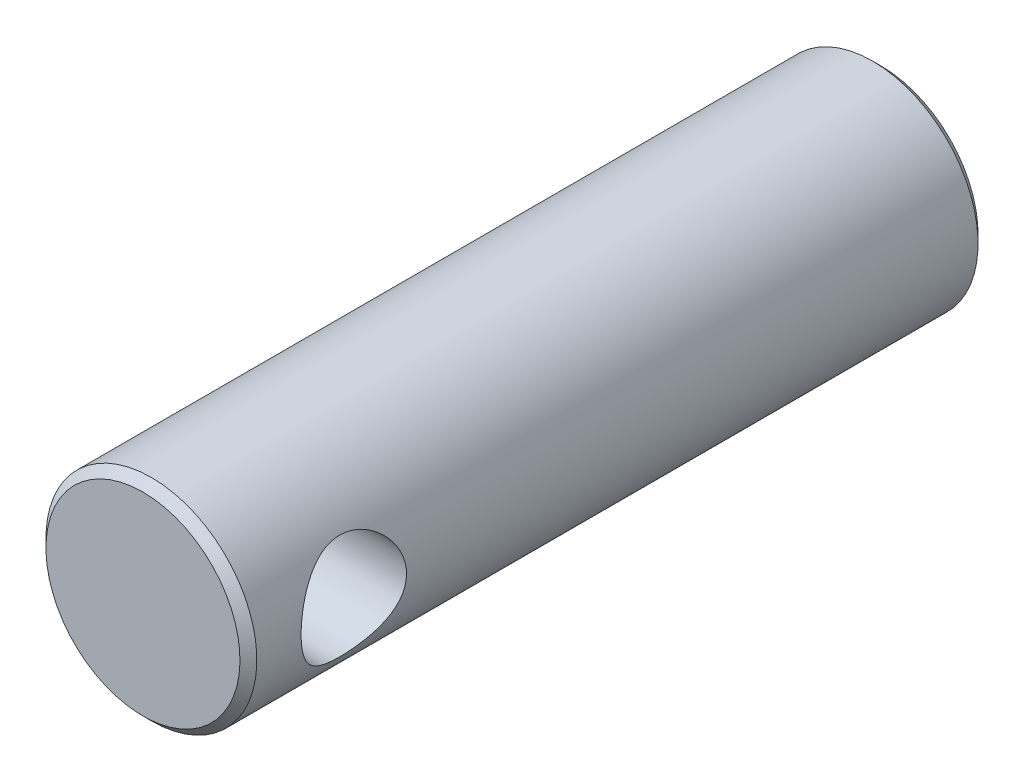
ISO-10303-21;
HEADER;
FILE_DESCRIPTION(('STEP AP214'),'2;1');
FILE_NAME('part.step','',(''),(''),'','','');
FILE_SCHEMA(('AUTOMOTIVE_DESIGN { 1 0 10303 214 1 1 1 1 }'));
ENDSEC;
DATA;
#1=APPLICATION_CONTEXT('core data for automotive mechanical design processes');
#2=APPLICATION_PROTOCOL_DEFINITION('international standard','automotive_design',2000,#1);
#3=PRODUCT_CONTEXT('',#1,'mechanical');
#4=PRODUCT('Part','Part','',(#3));
#5=PRODUCT_RELATED_PRODUCT_CATEGORY('part','',(#4));
#6=PRODUCT_DEFINITION_FORMATION('','',#4);
#7=PRODUCT_DEFINITION_CONTEXT('part definition',#1,'design');
#8=PRODUCT_DEFINITION('design','',#6,#7);
#9=PRODUCT_DEFINITION_SHAPE('','',#8);
#10=(LENGTH_UNIT() NAMED_UNIT(*) SI_UNIT(.MILLI.,.METRE.));
#11=(NAMED_UNIT(*) PLANE_ANGLE_UNIT() SI_UNIT($,.RADIAN.));
#12=(NAMED_UNIT(*) SI_UNIT($,.STERADIAN.) SOLID_ANGLE_UNIT());
#13=UNCERTAINTY_MEASURE_WITH_UNIT(LENGTH_MEASURE(1.E-05),#10,'distance_accuracy_value','');
#14=(GEOMETRIC_REPRESENTATION_CONTEXT(3) GLOBAL_UNCERTAINTY_ASSIGNED_CONTEXT((#13)) GLOBAL_UNIT_ASSIGNED_CONTEXT((#10,
#11,#12)) REPRESENTATION_CONTEXT('',''));
#15=CARTESIAN_POINT('',(0.,0.,0.));
#16=DIRECTION('',(0.,0.,1.));
#17=DIRECTION('',(1.,0.,0.));
#18=AXIS2_PLACEMENT_3D('',#15,#16,#17);
#19=CARTESIAN_POINT('',(0.,0.,0.));
#20=DIRECTION('',(0.,0.,-1.));
#21=DIRECTION('',(0.,1.,0.));
#22=AXIS2_PLACEMENT_3D('',#19,#20,#21);
#23=CYLINDRICAL_SURFACE('',#22,10.);
#24=CARTESIAN_POINT('',(0.,0.,0.8));
#25=DIRECTION('',(0.,0.,-1.));
#26=DIRECTION('',(0.,1.,0.));
#27=AXIS2_PLACEMENT_3D('',#24,#25,#26);
#28=CIRCLE('',#27,10.);
#29=CARTESIAN_POINT('',(0.,10.,0.8));
#30=VERTEX_POINT('',#29);
#31=EDGE_CURVE('E23',#30,#30,#28,.T.);
#32=ORIENTED_EDGE('',*,*,#31,.F.);
#33=EDGE_LOOP('',(#32));
#34=FACE_BOUND('',#33,.T.);
#35=CARTESIAN_POINT('',(10.,0.,55.));
#36=CARTESIAN_POINT('',(9.99999960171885,-0.13148889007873,55.000000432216));
#37=CARTESIAN_POINT('',(9.99740053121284,-0.262986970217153,55.0051927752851));
#38=CARTESIAN_POINT('',(9.98706977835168,-0.525014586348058,55.025902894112));
#39=CARTESIAN_POINT('',(9.97933586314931,-0.655543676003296,55.041425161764));
#40=CARTESIAN_POINT('',(9.95892066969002,-0.914783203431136,55.0826407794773));
#41=CARTESIAN_POINT('',(9.94623233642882,-1.04349077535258,55.1083486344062));
#42=CARTESIAN_POINT('',(9.91622716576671,-1.29802636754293,55.1696506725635));
#43=CARTESIAN_POINT('',(9.89890843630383,-1.42385318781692,55.2052488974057));
#44=CARTESIAN_POINT('',(9.86015430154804,-1.67121386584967,55.2857784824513));
#45=CARTESIAN_POINT('',(9.83873709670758,-1.79276399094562,55.3306686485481));
#46=CARTESIAN_POINT('',(9.79224427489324,-2.03144447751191,55.4294487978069));
#47=CARTESIAN_POINT('',(9.7671672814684,-2.14857315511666,55.4833421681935));
#48=CARTESIAN_POINT('',(9.68730860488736,-2.49222561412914,55.657799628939));
#49=CARTESIAN_POINT('',(9.6278546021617,-2.71128846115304,55.79123077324));
#50=CARTESIAN_POINT('',(9.49780663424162,-3.13758045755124,56.0976052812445));
#51=CARTESIAN_POINT('',(9.42675632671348,-3.34329192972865,56.2724506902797));
#52=CARTESIAN_POINT('',(9.28300214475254,-3.72388133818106,56.6525890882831));
#53=CARTESIAN_POINT('',(9.21029705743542,-3.89873577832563,56.8579050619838));
#54=CARTESIAN_POINT('',(9.06493867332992,-4.22628385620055,57.3124751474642));
#55=CARTESIAN_POINT('',(8.99272664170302,-4.37620734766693,57.5639018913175));
#56=CARTESIAN_POINT('',(8.89637417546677,-4.56723365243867,57.9599180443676));
#57=CARTESIAN_POINT('',(8.86624279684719,-4.62527981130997,58.0951182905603));
#58=CARTESIAN_POINT('',(8.81109611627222,-4.72948843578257,58.3710012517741));
#59=CARTESIAN_POINT('',(8.78607778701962,-4.77565793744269,58.5116806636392));
#60=CARTESIAN_POINT('',(8.74350562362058,-4.8531380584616,58.788992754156));
#61=CARTESIAN_POINT('',(8.72559704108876,-4.88516762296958,58.9253704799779));
#62=CARTESIAN_POINT('',(8.69596333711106,-4.93772573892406,59.2009256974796));
#63=CARTESIAN_POINT('',(8.68423493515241,-4.95826039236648,59.3401016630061));
#64=CARTESIAN_POINT('',(8.66746161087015,-4.98752398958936,59.6200074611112));
#65=CARTESIAN_POINT('',(8.66241266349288,-4.99626004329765,59.7607363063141));
#66=CARTESIAN_POINT('',(8.65921299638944,-5.00180399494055,60.0425011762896));
#67=CARTESIAN_POINT('',(8.66106161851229,-4.99861303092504,60.1835371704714));
#68=CARTESIAN_POINT('',(8.67093727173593,-4.98145803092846,60.447703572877));
#69=CARTESIAN_POINT('',(8.6781966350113,-4.96883208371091,60.5709526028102));
#70=CARTESIAN_POINT('',(8.69773906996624,-4.93454402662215,60.8158212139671));
#71=CARTESIAN_POINT('',(8.71002371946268,-4.91287907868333,60.937440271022));
#72=CARTESIAN_POINT('',(8.7392147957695,-4.86076278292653,61.1781978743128));
#73=CARTESIAN_POINT('',(8.75612065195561,-4.83031251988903,61.2973367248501));
#74=CARTESIAN_POINT('',(8.79403073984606,-4.76094319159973,61.5324713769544));
#75=CARTESIAN_POINT('',(8.81503658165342,-4.72202079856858,61.6484659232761));
#76=CARTESIAN_POINT('',(8.88436032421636,-4.59108661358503,61.9960068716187));
#77=CARTESIAN_POINT('',(8.93828791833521,-4.48608785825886,62.2216933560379));
#78=CARTESIAN_POINT('',(9.05517433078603,-4.24519591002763,62.6532101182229));
#79=CARTESIAN_POINT('',(9.11813720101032,-4.10928884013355,62.8590314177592));
#80=CARTESIAN_POINT('',(9.25565455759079,-3.79034422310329,63.2725885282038));
#81=CARTESIAN_POINT('',(9.33066654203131,-3.60351571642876,63.4772580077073));
#82=CARTESIAN_POINT('',(9.47739013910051,-3.19773444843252,63.8537034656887));
#83=CARTESIAN_POINT('',(9.54910016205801,-2.978766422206,64.0254637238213));
#84=CARTESIAN_POINT('',(9.65034506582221,-2.62430600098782,64.2584408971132));
#85=CARTESIAN_POINT('',(9.68370380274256,-2.49871002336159,64.3333520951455));
#86=CARTESIAN_POINT('',(9.74663052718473,-2.24071060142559,64.4722082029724));
#87=CARTESIAN_POINT('',(9.77620011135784,-2.10831005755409,64.5361577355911));
#88=CARTESIAN_POINT('',(9.83067553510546,-1.83762803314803,64.6523988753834));
#89=CARTESIAN_POINT('',(9.85558325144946,-1.69934894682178,64.7046951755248));
#90=CARTESIAN_POINT('',(9.89999026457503,-1.41791187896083,64.79702492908));
#91=CARTESIAN_POINT('',(9.91949018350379,-1.27475446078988,64.8370597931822));
#92=CARTESIAN_POINT('',(9.95109597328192,-0.996798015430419,64.901533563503));
#93=CARTESIAN_POINT('',(9.96368046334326,-0.8622886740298,64.9269895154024));
#94=CARTESIAN_POINT('',(9.98343035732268,-0.591248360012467,64.9668080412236));
#95=CARTESIAN_POINT('',(9.99059624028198,-0.454717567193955,64.9811715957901));
#96=CARTESIAN_POINT('',(9.99930380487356,-0.180810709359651,64.9986131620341));
#97=CARTESIAN_POINT('',(10.000847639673,-0.043434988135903,65.0016954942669));
#98=CARTESIAN_POINT('',(9.99827237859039,0.231047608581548,64.9965444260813));
#99=CARTESIAN_POINT('',(9.99415353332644,0.368154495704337,64.9883115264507));
#100=CARTESIAN_POINT('',(9.98090973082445,0.630324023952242,64.961721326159));
#101=CARTESIAN_POINT('',(9.97219922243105,0.755493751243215,64.9442016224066));
#102=CARTESIAN_POINT('',(9.95027227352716,1.00380426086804,64.8998255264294));
#103=CARTESIAN_POINT('',(9.93705440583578,1.12694438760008,64.8729661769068));
#104=CARTESIAN_POINT('',(9.90642450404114,1.37032307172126,64.8101973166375));
#105=CARTESIAN_POINT('',(9.88901375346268,1.49056250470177,64.7742905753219));
#106=CARTESIAN_POINT('',(9.85039368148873,1.72747946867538,64.6937718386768));
#107=CARTESIAN_POINT('',(9.8291829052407,1.84415561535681,64.6491565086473));
#108=CARTESIAN_POINT('',(9.75922876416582,2.19430354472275,64.5000521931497));
#109=CARTESIAN_POINT('',(9.70504904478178,2.42111320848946,64.3820592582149));
#110=CARTESIAN_POINT('',(9.58719375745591,2.85234560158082,64.1144478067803));
#111=CARTESIAN_POINT('',(9.5235141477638,3.05675873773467,63.9648158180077));
#112=CARTESIAN_POINT('',(9.38541505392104,3.45882132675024,63.6212127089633));
#113=CARTESIAN_POINT('',(9.31055499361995,3.65383533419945,63.4243304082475));
#114=CARTESIAN_POINT('',(9.16310881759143,4.00930667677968,63.0003294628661));
#115=CARTESIAN_POINT('',(9.09052430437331,4.16974010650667,62.7731900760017));
#116=CARTESIAN_POINT('',(8.98785260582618,4.38466016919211,62.4075094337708));
#117=CARTESIAN_POINT('',(8.95395955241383,4.45326762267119,62.2781491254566));
#118=CARTESIAN_POINT('',(8.89022352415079,4.57918112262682,62.0131058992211));
#119=CARTESIAN_POINT('',(8.8603787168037,4.63649228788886,61.8774258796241));
#120=CARTESIAN_POINT('',(8.80590327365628,4.73913999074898,61.6007229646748));
#121=CARTESIAN_POINT('',(8.78126837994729,4.78448631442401,61.45970454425));
#122=CARTESIAN_POINT('',(8.73822819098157,4.86265004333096,61.1733089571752));
#123=CARTESIAN_POINT('',(8.71982193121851,4.89546938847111,61.0279324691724));
#124=CARTESIAN_POINT('',(8.69151275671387,4.94553834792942,60.7482350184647));
#125=CARTESIAN_POINT('',(8.68096327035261,4.96397997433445,60.61419211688));
#126=CARTESIAN_POINT('',(8.66606824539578,4.98993873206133,60.3447147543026));
#127=CARTESIAN_POINT('',(8.66172205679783,4.99745700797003,60.2092804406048));
#128=CARTESIAN_POINT('',(8.65941425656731,5.00145477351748,59.9382430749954));
#129=CARTESIAN_POINT('',(8.66145040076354,4.99793814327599,59.8026400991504));
#130=CARTESIAN_POINT('',(8.67181681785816,4.97992974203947,59.5324144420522));
#131=CARTESIAN_POINT('',(8.68014683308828,4.96543842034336,59.3977917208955));
#132=CARTESIAN_POINT('',(8.70167828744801,4.92759757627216,59.143439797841));
#133=CARTESIAN_POINT('',(8.71433770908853,4.90522766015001,59.0235174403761));
#134=CARTESIAN_POINT('',(8.74411599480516,4.85194376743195,58.7861388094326));
#135=CARTESIAN_POINT('',(8.76123623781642,4.82102714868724,58.668683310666));
#136=CARTESIAN_POINT('',(8.81854231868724,4.7159030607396,58.3210828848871));
#137=CARTESIAN_POINT('',(8.86468813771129,4.62929708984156,58.095543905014));
#138=CARTESIAN_POINT('',(8.97142890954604,4.41907164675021,57.6468396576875));
#139=CARTESIAN_POINT('',(9.03278633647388,4.29335633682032,57.4248519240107));
#140=CARTESIAN_POINT('',(9.16176636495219,4.01075421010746,57.0036358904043));
#141=CARTESIAN_POINT('',(9.22939221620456,3.85385117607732,56.8044195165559));
#142=CARTESIAN_POINT('',(9.37311444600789,3.49102748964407,56.4092921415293));
#143=CARTESIAN_POINT('',(9.44924162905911,3.28146736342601,56.2167239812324));
#144=CARTESIAN_POINT('',(9.59389514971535,2.83072875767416,55.8686655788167));
#145=CARTESIAN_POINT('',(9.66241737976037,2.58953334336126,55.7131953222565));
#146=CARTESIAN_POINT('',(9.7541901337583,2.20753881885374,55.5113695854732));
#147=CARTESIAN_POINT('',(9.78304209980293,2.07625512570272,55.4491329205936));
#148=CARTESIAN_POINT('',(9.83614745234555,1.80799529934,55.3360638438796));
#149=CARTESIAN_POINT('',(9.86040309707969,1.67102200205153,55.2852258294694));
#150=CARTESIAN_POINT('',(9.90354484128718,1.39269501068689,55.1956545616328));
#151=CARTESIAN_POINT('',(9.92244264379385,1.25135162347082,55.1568949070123));
#152=CARTESIAN_POINT('',(9.95434618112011,0.965237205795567,55.0918624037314));
#153=CARTESIAN_POINT('',(9.96735551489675,0.820468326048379,55.065581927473));
#154=CARTESIAN_POINT('',(9.98476387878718,0.563041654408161,55.0305254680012));
#155=CARTESIAN_POINT('',(9.99046741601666,0.450825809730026,55.019088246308));
#156=CARTESIAN_POINT('',(9.99808569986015,0.225742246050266,55.0038252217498));
#157=CARTESIAN_POINT('',(10.000000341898,0.112874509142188,54.9999996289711));
#158=CARTESIAN_POINT('',(10.,0.,55.));
#159=B_SPLINE_CURVE_WITH_KNOTS('',3,(#35,#36,#37,#38,#39,#40,#41,#42,#43,#44,#45,#46,#47,#48,
#49,#50,#51,#52,#53,#54,#55,#56,#57,#58,#59,#60,#61,#62,#63,#64,#65,#66,#67,#68,#69,#70,#71,#72,
#73,#74,#75,#76,#77,#78,#79,#80,#81,#82,#83,#84,#85,#86,#87,#88,#89,#90,#91,#92,#93,#94,#95,#96,
#97,#98,#99,#100,#101,#102,#103,#104,#105,#106,#107,#108,#109,#110,#111,#112,#113,#114,#115,
#116,#117,#118,#119,#120,#121,#122,#123,#124,#125,#126,#127,#128,#129,#130,#131,#132,#133,#134,
#135,#136,#137,#138,#139,#140,#141,#142,#143,#144,#145,#146,#147,#148,#149,#150,#151,#152,#153,
#154,#155,#156,#157,#158),.UNSPECIFIED.,.T.,.F.,(4,2,2,2,2,2,2,2,2,2,2,2,2,2,2,2,2,2,2,2,2,2,2,
2,2,2,2,2,2,2,2,2,2,2,2,2,2,2,2,2,2,2,2,2,2,2,2,2,2,2,2,2,2,2,2,2,2,2,2,2,2,4),(0.,
0.394355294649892,0.788882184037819,1.18397293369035,1.57922537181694,1.97276168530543,
2.36644639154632,3.15295441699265,3.98704440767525,4.82176680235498,5.72122193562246,
6.1712535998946,6.62101803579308,7.04410338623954,7.4669639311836,7.88956954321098,
8.31213483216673,8.68401534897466,9.05601271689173,9.42796417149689,9.80006198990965,
10.5608338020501,11.3219478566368,12.1795688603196,13.03759852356,13.4870830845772,
13.9363776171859,14.3854908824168,14.8345524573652,15.2464230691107,15.6582572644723,
16.0699337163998,16.4815919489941,16.8612200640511,17.240968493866,17.6206008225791,
18.0003788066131,18.7808755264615,19.5617052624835,20.4192132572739,21.2773121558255,
21.7277011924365,22.1778856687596,22.6277007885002,23.0774462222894,23.4840267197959,
23.8905646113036,24.2969595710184,24.703337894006,25.0708552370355,25.4384863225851,
26.1732662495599,26.9574126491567,27.7419678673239,28.6218519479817,29.5022089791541,
29.9460734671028,30.3897193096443,30.8323885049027,31.2747867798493,31.6133053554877,
31.9518332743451),.UNSPECIFIED.);
#160=CARTESIAN_POINT('',(10.,0.,55.));
#161=VERTEX_POINT('',#160);
#162=EDGE_CURVE('E30',#161,#161,#159,.T.);
#163=ORIENTED_EDGE('',*,*,#162,.T.);
#164=EDGE_LOOP('',(#163));
#165=FACE_BOUND('',#164,.T.);
#166=CARTESIAN_POINT('',(0.,0.,69.2));
#167=DIRECTION('',(0.,0.,-1.));
#168=DIRECTION('',(0.,1.,0.));
#169=AXIS2_PLACEMENT_3D('',#166,#167,#168);
#170=CIRCLE('',#169,10.);
#171=CARTESIAN_POINT('',(0.,10.,69.2));
#172=VERTEX_POINT('',#171);
#173=EDGE_CURVE('E37',#172,#172,#170,.T.);
#174=ORIENTED_EDGE('',*,*,#173,.T.);
#175=EDGE_LOOP('',(#174));
#176=FACE_BOUND('',#175,.T.);
#177=CARTESIAN_POINT('',(-10.,0.,55.));
#178=CARTESIAN_POINT('',(-9.99999960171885,0.13148889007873,55.000000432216));
#179=CARTESIAN_POINT('',(-9.99740053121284,0.262986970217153,55.0051927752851));
#180=CARTESIAN_POINT('',(-9.98706977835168,0.525014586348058,55.025902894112));
#181=CARTESIAN_POINT('',(-9.97933586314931,0.655543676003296,55.041425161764));
#182=CARTESIAN_POINT('',(-9.95892066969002,0.914783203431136,55.0826407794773));
#183=CARTESIAN_POINT('',(-9.94623233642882,1.04349077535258,55.1083486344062));
#184=CARTESIAN_POINT('',(-9.91622716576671,1.29802636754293,55.1696506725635));
#185=CARTESIAN_POINT('',(-9.89890843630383,1.42385318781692,55.2052488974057));
#186=CARTESIAN_POINT('',(-9.86015430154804,1.67121386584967,55.2857784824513));
#187=CARTESIAN_POINT('',(-9.83873709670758,1.79276399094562,55.3306686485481));
#188=CARTESIAN_POINT('',(-9.79224427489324,2.03144447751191,55.4294487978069));
#189=CARTESIAN_POINT('',(-9.7671672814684,2.14857315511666,55.4833421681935));
#190=CARTESIAN_POINT('',(-9.68730860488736,2.49222561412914,55.657799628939));
#191=CARTESIAN_POINT('',(-9.6278546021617,2.71128846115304,55.79123077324));
#192=CARTESIAN_POINT('',(-9.49780663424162,3.13758045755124,56.0976052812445));
#193=CARTESIAN_POINT('',(-9.42675632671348,3.34329192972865,56.2724506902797));
#194=CARTESIAN_POINT('',(-9.28300214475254,3.72388133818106,56.6525890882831));
#195=CARTESIAN_POINT('',(-9.21029705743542,3.89873577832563,56.8579050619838));
#196=CARTESIAN_POINT('',(-9.06493867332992,4.22628385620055,57.3124751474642));
#197=CARTESIAN_POINT('',(-8.99272664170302,4.37620734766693,57.5639018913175));
#198=CARTESIAN_POINT('',(-8.89637417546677,4.56723365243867,57.9599180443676));
#199=CARTESIAN_POINT('',(-8.86624279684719,4.62527981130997,58.0951182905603));
#200=CARTESIAN_POINT('',(-8.81109611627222,4.72948843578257,58.3710012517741));
#201=CARTESIAN_POINT('',(-8.78607778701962,4.77565793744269,58.5116806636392));
#202=CARTESIAN_POINT('',(-8.74350562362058,4.8531380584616,58.788992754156));
#203=CARTESIAN_POINT('',(-8.72559704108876,4.88516762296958,58.9253704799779));
#204=CARTESIAN_POINT('',(-8.69596333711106,4.93772573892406,59.2009256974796));
#205=CARTESIAN_POINT('',(-8.68423493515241,4.95826039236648,59.3401016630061));
#206=CARTESIAN_POINT('',(-8.66746161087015,4.98752398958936,59.6200074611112));
#207=CARTESIAN_POINT('',(-8.66241266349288,4.99626004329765,59.7607363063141));
#208=CARTESIAN_POINT('',(-8.65921299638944,5.00180399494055,60.0425011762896));
#209=CARTESIAN_POINT('',(-8.66106161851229,4.99861303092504,60.1835371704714));
#210=CARTESIAN_POINT('',(-8.67093727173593,4.98145803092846,60.447703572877));
#211=CARTESIAN_POINT('',(-8.6781966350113,4.96883208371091,60.5709526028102));
#212=CARTESIAN_POINT('',(-8.69773906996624,4.93454402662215,60.8158212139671));
#213=CARTESIAN_POINT('',(-8.71002371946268,4.91287907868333,60.937440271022));
#214=CARTESIAN_POINT('',(-8.7392147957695,4.86076278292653,61.1781978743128));
#215=CARTESIAN_POINT('',(-8.75612065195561,4.83031251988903,61.2973367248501));
#216=CARTESIAN_POINT('',(-8.79403073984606,4.76094319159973,61.5324713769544));
#217=CARTESIAN_POINT('',(-8.81503658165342,4.72202079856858,61.6484659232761));
#218=CARTESIAN_POINT('',(-8.88436032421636,4.59108661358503,61.9960068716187));
#219=CARTESIAN_POINT('',(-8.93828791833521,4.48608785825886,62.2216933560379));
#220=CARTESIAN_POINT('',(-9.05517433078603,4.24519591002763,62.6532101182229));
#221=CARTESIAN_POINT('',(-9.11813720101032,4.10928884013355,62.8590314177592));
#222=CARTESIAN_POINT('',(-9.25565455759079,3.79034422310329,63.2725885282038));
#223=CARTESIAN_POINT('',(-9.33066654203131,3.60351571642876,63.4772580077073));
#224=CARTESIAN_POINT('',(-9.47739013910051,3.19773444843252,63.8537034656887));
#225=CARTESIAN_POINT('',(-9.54910016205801,2.978766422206,64.0254637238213));
#226=CARTESIAN_POINT('',(-9.65034506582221,2.62430600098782,64.2584408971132));
#227=CARTESIAN_POINT('',(-9.68370380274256,2.49871002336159,64.3333520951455));
#228=CARTESIAN_POINT('',(-9.74663052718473,2.24071060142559,64.4722082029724));
#229=CARTESIAN_POINT('',(-9.77620011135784,2.10831005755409,64.5361577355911));
#230=CARTESIAN_POINT('',(-9.83067553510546,1.83762803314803,64.6523988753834));
#231=CARTESIAN_POINT('',(-9.85558325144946,1.69934894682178,64.7046951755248));
#232=CARTESIAN_POINT('',(-9.89999026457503,1.41791187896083,64.79702492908));
#233=CARTESIAN_POINT('',(-9.91949018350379,1.27475446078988,64.8370597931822));
#234=CARTESIAN_POINT('',(-9.95109597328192,0.996798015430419,64.901533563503));
#235=CARTESIAN_POINT('',(-9.96368046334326,0.8622886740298,64.9269895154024));
#236=CARTESIAN_POINT('',(-9.98343035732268,0.591248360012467,64.9668080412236));
#237=CARTESIAN_POINT('',(-9.99059624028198,0.454717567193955,64.9811715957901));
#238=CARTESIAN_POINT('',(-9.99930380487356,0.180810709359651,64.9986131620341));
#239=CARTESIAN_POINT('',(-10.000847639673,0.043434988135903,65.0016954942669));
#240=CARTESIAN_POINT('',(-9.99827237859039,-0.231047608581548,64.9965444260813));
#241=CARTESIAN_POINT('',(-9.99415353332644,-0.368154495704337,64.9883115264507));
#242=CARTESIAN_POINT('',(-9.98090973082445,-0.630324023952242,64.961721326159));
#243=CARTESIAN_POINT('',(-9.97219922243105,-0.755493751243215,64.9442016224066));
#244=CARTESIAN_POINT('',(-9.95027227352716,-1.00380426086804,64.8998255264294));
#245=CARTESIAN_POINT('',(-9.93705440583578,-1.12694438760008,64.8729661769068));
#246=CARTESIAN_POINT('',(-9.90642450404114,-1.37032307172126,64.8101973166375));
#247=CARTESIAN_POINT('',(-9.88901375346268,-1.49056250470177,64.7742905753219));
#248=CARTESIAN_POINT('',(-9.85039368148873,-1.72747946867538,64.6937718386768));
#249=CARTESIAN_POINT('',(-9.8291829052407,-1.84415561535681,64.6491565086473));
#250=CARTESIAN_POINT('',(-9.75922876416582,-2.19430354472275,64.5000521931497));
#251=CARTESIAN_POINT('',(-9.70504904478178,-2.42111320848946,64.3820592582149));
#252=CARTESIAN_POINT('',(-9.58719375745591,-2.85234560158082,64.1144478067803));
#253=CARTESIAN_POINT('',(-9.5235141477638,-3.05675873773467,63.9648158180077));
#254=CARTESIAN_POINT('',(-9.38541505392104,-3.45882132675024,63.6212127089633));
#255=CARTESIAN_POINT('',(-9.31055499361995,-3.65383533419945,63.4243304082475));
#256=CARTESIAN_POINT('',(-9.16310881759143,-4.00930667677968,63.0003294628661));
#257=CARTESIAN_POINT('',(-9.09052430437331,-4.16974010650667,62.7731900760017));
#258=CARTESIAN_POINT('',(-8.98785260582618,-4.38466016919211,62.4075094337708));
#259=CARTESIAN_POINT('',(-8.95395955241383,-4.45326762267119,62.2781491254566));
#260=CARTESIAN_POINT('',(-8.89022352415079,-4.57918112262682,62.0131058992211));
#261=CARTESIAN_POINT('',(-8.8603787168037,-4.63649228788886,61.8774258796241));
#262=CARTESIAN_POINT('',(-8.80590327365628,-4.73913999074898,61.6007229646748));
#263=CARTESIAN_POINT('',(-8.78126837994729,-4.78448631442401,61.45970454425));
#264=CARTESIAN_POINT('',(-8.73822819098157,-4.86265004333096,61.1733089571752));
#265=CARTESIAN_POINT('',(-8.71982193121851,-4.89546938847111,61.0279324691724));
#266=CARTESIAN_POINT('',(-8.69151275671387,-4.94553834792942,60.7482350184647));
#267=CARTESIAN_POINT('',(-8.68096327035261,-4.96397997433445,60.61419211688));
#268=CARTESIAN_POINT('',(-8.66606824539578,-4.98993873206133,60.3447147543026));
#269=CARTESIAN_POINT('',(-8.66172205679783,-4.99745700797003,60.2092804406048));
#270=CARTESIAN_POINT('',(-8.65941425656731,-5.00145477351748,59.9382430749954));
#271=CARTESIAN_POINT('',(-8.66145040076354,-4.99793814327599,59.8026400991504));
#272=CARTESIAN_POINT('',(-8.67181681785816,-4.97992974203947,59.5324144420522));
#273=CARTESIAN_POINT('',(-8.68014683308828,-4.96543842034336,59.3977917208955));
#274=CARTESIAN_POINT('',(-8.70167828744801,-4.92759757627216,59.143439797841));
#275=CARTESIAN_POINT('',(-8.71433770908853,-4.90522766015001,59.0235174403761));
#276=CARTESIAN_POINT('',(-8.74411599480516,-4.85194376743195,58.7861388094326));
#277=CARTESIAN_POINT('',(-8.76123623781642,-4.82102714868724,58.668683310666));
#278=CARTESIAN_POINT('',(-8.81854231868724,-4.7159030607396,58.3210828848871));
#279=CARTESIAN_POINT('',(-8.86468813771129,-4.62929708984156,58.095543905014));
#280=CARTESIAN_POINT('',(-8.97142890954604,-4.41907164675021,57.6468396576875));
#281=CARTESIAN_POINT('',(-9.03278633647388,-4.29335633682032,57.4248519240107));
#282=CARTESIAN_POINT('',(-9.16176636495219,-4.01075421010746,57.0036358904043));
#283=CARTESIAN_POINT('',(-9.22939221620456,-3.85385117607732,56.8044195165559));
#284=CARTESIAN_POINT('',(-9.37311444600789,-3.49102748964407,56.4092921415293));
#285=CARTESIAN_POINT('',(-9.44924162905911,-3.28146736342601,56.2167239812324));
#286=CARTESIAN_POINT('',(-9.59389514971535,-2.83072875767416,55.8686655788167));
#287=CARTESIAN_POINT('',(-9.66241737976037,-2.58953334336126,55.7131953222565));
#288=CARTESIAN_POINT('',(-9.7541901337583,-2.20753881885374,55.5113695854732));
#289=CARTESIAN_POINT('',(-9.78304209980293,-2.07625512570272,55.4491329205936));
#290=CARTESIAN_POINT('',(-9.83614745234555,-1.80799529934,55.3360638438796));
#291=CARTESIAN_POINT('',(-9.86040309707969,-1.67102200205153,55.2852258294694));
#292=CARTESIAN_POINT('',(-9.90354484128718,-1.39269501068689,55.1956545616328));
#293=CARTESIAN_POINT('',(-9.92244264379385,-1.25135162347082,55.1568949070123));
#294=CARTESIAN_POINT('',(-9.95434618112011,-0.965237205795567,55.0918624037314));
#295=CARTESIAN_POINT('',(-9.96735551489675,-0.820468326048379,55.065581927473));
#296=CARTESIAN_POINT('',(-9.98476387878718,-0.563041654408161,55.0305254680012));
#297=CARTESIAN_POINT('',(-9.99046741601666,-0.450825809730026,55.019088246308));
#298=CARTESIAN_POINT('',(-9.99808569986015,-0.225742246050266,55.0038252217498));
#299=CARTESIAN_POINT('',(-10.000000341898,-0.112874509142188,54.9999996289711));
#300=CARTESIAN_POINT('',(-10.,0.,55.));
#301=B_SPLINE_CURVE_WITH_KNOTS('',3,(#177,#178,#179,#180,#181,#182,#183,#184,#185,#186,#187,
#188,#189,#190,#191,#192,#193,#194,#195,#196,#197,#198,#199,#200,#201,#202,#203,#204,#205,#206,
#207,#208,#209,#210,#211,#212,#213,#214,#215,#216,#217,#218,#219,#220,#221,#222,#223,#224,#225,
#226,#227,#228,#229,#230,#231,#232,#233,#234,#235,#236,#237,#238,#239,#240,#241,#242,#243,#244,
#245,#246,#247,#248,#249,#250,#251,#252,#253,#254,#255,#256,#257,#258,#259,#260,#261,#262,#263,
#264,#265,#266,#267,#268,#269,#270,#271,#272,#273,#274,#275,#276,#277,#278,#279,#280,#281,#282,
#283,#284,#285,#286,#287,#288,#289,#290,#291,#292,#293,#294,#295,#296,#297,#298,#299,#300),
.UNSPECIFIED.,.T.,.F.,(4,2,2,2,2,2,2,2,2,2,2,2,2,2,2,2,2,2,2,2,2,2,2,2,2,2,2,2,2,2,2,2,2,2,2,2,
2,2,2,2,2,2,2,2,2,2,2,2,2,2,2,2,2,2,2,2,2,2,2,2,2,4),(0.,0.394355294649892,0.788882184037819,
1.18397293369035,1.57922537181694,1.97276168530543,2.36644639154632,3.15295441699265,
3.98704440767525,4.82176680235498,5.72122193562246,6.1712535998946,6.62101803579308,
7.04410338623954,7.4669639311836,7.88956954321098,8.31213483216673,8.68401534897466,
9.05601271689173,9.42796417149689,9.80006198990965,10.5608338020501,11.3219478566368,
12.1795688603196,13.03759852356,13.4870830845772,13.9363776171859,14.3854908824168,
14.8345524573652,15.2464230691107,15.6582572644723,16.0699337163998,16.4815919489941,
16.8612200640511,17.240968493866,17.6206008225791,18.0003788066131,18.7808755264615,
19.5617052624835,20.4192132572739,21.2773121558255,21.7277011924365,22.1778856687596,
22.6277007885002,23.0774462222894,23.4840267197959,23.8905646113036,24.2969595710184,
24.703337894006,25.0708552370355,25.4384863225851,26.1732662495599,26.9574126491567,
27.7419678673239,28.6218519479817,29.5022089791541,29.9460734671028,30.3897193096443,
30.8323885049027,31.2747867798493,31.6133053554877,31.9518332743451),.UNSPECIFIED.);
#302=CARTESIAN_POINT('',(-10.,0.,55.));
#303=VERTEX_POINT('',#302);
#304=EDGE_CURVE('E39',#303,#303,#301,.T.);
#305=ORIENTED_EDGE('',*,*,#304,.T.);
#306=EDGE_LOOP('',(#305));
#307=FACE_BOUND('',#306,.T.);
#308=ADVANCED_FACE('F12',(#34,#165,#176,#307),#23,.T.);
#309=CARTESIAN_POINT('',(9.2,0.,0.));
#310=DIRECTION('',(0.,0.,1.));
#311=DIRECTION('',(0.,-1.,0.));
#312=AXIS2_PLACEMENT_3D('',#309,#310,#311);
#313=PLANE('',#312);
#314=CARTESIAN_POINT('',(0.,0.,0.));
#315=DIRECTION('',(0.,0.,1.));
#316=DIRECTION('',(1.,0.,0.));
#317=AXIS2_PLACEMENT_3D('',#314,#315,#316);
#318=CIRCLE('',#317,7.);
#319=CARTESIAN_POINT('',(7.,0.,0.));
#320=VERTEX_POINT('',#319);
#321=EDGE_CURVE('E8',#320,#320,#318,.T.);
#322=ORIENTED_EDGE('',*,*,#321,.T.);
#323=EDGE_LOOP('',(#322));
#324=FACE_BOUND('',#323,.T.);
#325=CARTESIAN_POINT('',(0.,0.,0.));
#326=DIRECTION('',(0.,0.,-1.));
#327=DIRECTION('',(0.,1.,0.));
#328=AXIS2_PLACEMENT_3D('',#325,#326,#327);
#329=CIRCLE('',#328,9.2);
#330=CARTESIAN_POINT('',(0.,9.2,0.));
#331=VERTEX_POINT('',#330);
#332=EDGE_CURVE('E84',#331,#331,#329,.T.);
#333=ORIENTED_EDGE('',*,*,#332,.T.);
#334=EDGE_LOOP('',(#333));
#335=FACE_BOUND('',#334,.T.);
#336=ADVANCED_FACE('F54',(#324,#335),#313,.F.);
#337=CARTESIAN_POINT('',(0.,0.,70.));
#338=DIRECTION('',(0.,0.,-1.));
#339=DIRECTION('',(0.,1.,0.));
#340=AXIS2_PLACEMENT_3D('',#337,#338,#339);
#341=PLANE('',#340);
#342=CARTESIAN_POINT('',(0.,0.,70.));
#343=DIRECTION('',(0.,0.,-1.));
#344=DIRECTION('',(0.,1.,0.));
#345=AXIS2_PLACEMENT_3D('',#342,#343,#344);
#346=CIRCLE('',#345,9.2);
#347=CARTESIAN_POINT('',(0.,9.2,70.));
#348=VERTEX_POINT('',#347);
#349=EDGE_CURVE('E27',#348,#348,#346,.T.);
#350=ORIENTED_EDGE('',*,*,#349,.F.);
#351=EDGE_LOOP('',(#350));
#352=FACE_BOUND('',#351,.T.);
#353=ADVANCED_FACE('F57',(#352),#341,.F.);
#354=CARTESIAN_POINT('',(0.,0.,70.));
#355=DIRECTION('',(0.,0.,-1.));
#356=DIRECTION('',(0.,1.,0.));
#357=AXIS2_PLACEMENT_3D('',#354,#355,#356);
#358=CONICAL_SURFACE('',#357,9.2,0.785398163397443);
#359=ORIENTED_EDGE('',*,*,#173,.F.);
#360=EDGE_LOOP('',(#359));
#361=FACE_BOUND('',#360,.T.);
#362=ORIENTED_EDGE('',*,*,#349,.T.);
#363=EDGE_LOOP('',(#362));
#364=FACE_BOUND('',#363,.T.);
#365=ADVANCED_FACE('F59',(#361,#364),#358,.T.);
#366=CARTESIAN_POINT('',(0.,0.,0.8));
#367=DIRECTION('',(0.,0.,1.));
#368=DIRECTION('',(0.,-1.,0.));
#369=AXIS2_PLACEMENT_3D('',#366,#367,#368);
#370=CONICAL_SURFACE('',#369,10.,0.785398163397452);
#371=ORIENTED_EDGE('',*,*,#332,.F.);
#372=EDGE_LOOP('',(#371));
#373=FACE_BOUND('',#372,.T.);
#374=ORIENTED_EDGE('',*,*,#31,.T.);
#375=EDGE_LOOP('',(#374));
#376=FACE_BOUND('',#375,.T.);
#377=ADVANCED_FACE('F52',(#373,#376),#370,.T.);
#378=CARTESIAN_POINT('',(-20.001,0.,60.));
#379=DIRECTION('',(1.,0.,0.));
#380=DIRECTION('',(0.,0.,-1.));
#381=AXIS2_PLACEMENT_3D('',#378,#379,#380);
#382=CYLINDRICAL_SURFACE('',#381,5.);
#383=ORIENTED_EDGE('',*,*,#162,.F.);
#384=EDGE_LOOP('',(#383));
#385=FACE_BOUND('',#384,.T.);
#386=ORIENTED_EDGE('',*,*,#304,.F.);
#387=EDGE_LOOP('',(#386));
#388=FACE_BOUND('',#387,.T.);
#389=ADVANCED_FACE('F47',(#385,#388),#382,.F.);
#390=CARTESIAN_POINT('',(0.,0.,25.));
#391=DIRECTION('',(0.,0.,-1.));
#392=DIRECTION('',(-1.,0.,0.));
#393=AXIS2_PLACEMENT_3D('',#390,#391,#392);
#394=CYLINDRICAL_SURFACE('',#393,6.);
#395=CARTESIAN_POINT('',(0.,0.,1.00000000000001));
#396=DIRECTION('',(0.,0.,1.));
#397=DIRECTION('',(1.,0.,0.));
#398=AXIS2_PLACEMENT_3D('',#395,#396,#397);
#399=CIRCLE('',#398,6.);
#400=CARTESIAN_POINT('',(6.,0.,1.00000000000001));
#401=VERTEX_POINT('',#400);
#402=EDGE_CURVE('E19',#401,#401,#399,.F.);
#403=ORIENTED_EDGE('',*,*,#402,.T.);
#404=EDGE_LOOP('',(#403));
#405=FACE_BOUND('',#404,.T.);
#406=CARTESIAN_POINT('',(0.,0.,25.));
#407=DIRECTION('',(0.,0.,-1.));
#408=DIRECTION('',(-1.,0.,0.));
#409=AXIS2_PLACEMENT_3D('',#406,#407,#408);
#410=CIRCLE('',#409,6.);
#411=CARTESIAN_POINT('',(-6.,0.,25.));
#412=VERTEX_POINT('',#411);
#413=EDGE_CURVE('E38',#412,#412,#410,.T.);
#414=ORIENTED_EDGE('',*,*,#413,.F.);
#415=EDGE_LOOP('',(#414));
#416=FACE_BOUND('',#415,.T.);
#417=ADVANCED_FACE('F51',(#405,#416),#394,.F.);
#418=CARTESIAN_POINT('',(0.,0.,25.));
#419=DIRECTION('',(0.,0.,-1.));
#420=DIRECTION('',(-1.,0.,0.));
#421=AXIS2_PLACEMENT_3D('',#418,#419,#420);
#422=PLANE('',#421);
#423=ORIENTED_EDGE('',*,*,#413,.T.);
#424=EDGE_LOOP('',(#423));
#425=FACE_BOUND('',#424,.T.);
#426=ADVANCED_FACE('F93',(#425),#422,.T.);
#427=CARTESIAN_POINT('',(0.,0.,1.00000000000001));
#428=DIRECTION('',(0.,0.,-1.));
#429=DIRECTION('',(-1.,0.,0.));
#430=AXIS2_PLACEMENT_3D('',#427,#428,#429);
#431=CONICAL_SURFACE('',#430,6.,0.78539816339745);
#432=ORIENTED_EDGE('',*,*,#321,.F.);
#433=EDGE_LOOP('',(#432));
#434=FACE_BOUND('',#433,.T.);
#435=ORIENTED_EDGE('',*,*,#402,.F.);
#436=EDGE_LOOP('',(#435));
#437=FACE_BOUND('',#436,.T.);
#438=ADVANCED_FACE('F14',(#434,#437),#431,.F.);
#439=CLOSED_SHELL('',(#308,#336,#353,#365,#377,#389,#417,#426,#438));
#440=MANIFOLD_SOLID_BREP('B1',#439);
#441=ADVANCED_BREP_SHAPE_REPRESENTATION('',(#18,#440),#14);
#442=SHAPE_DEFINITION_REPRESENTATION(#9,#441);
ENDSEC;
END-ISO-10303-21;
